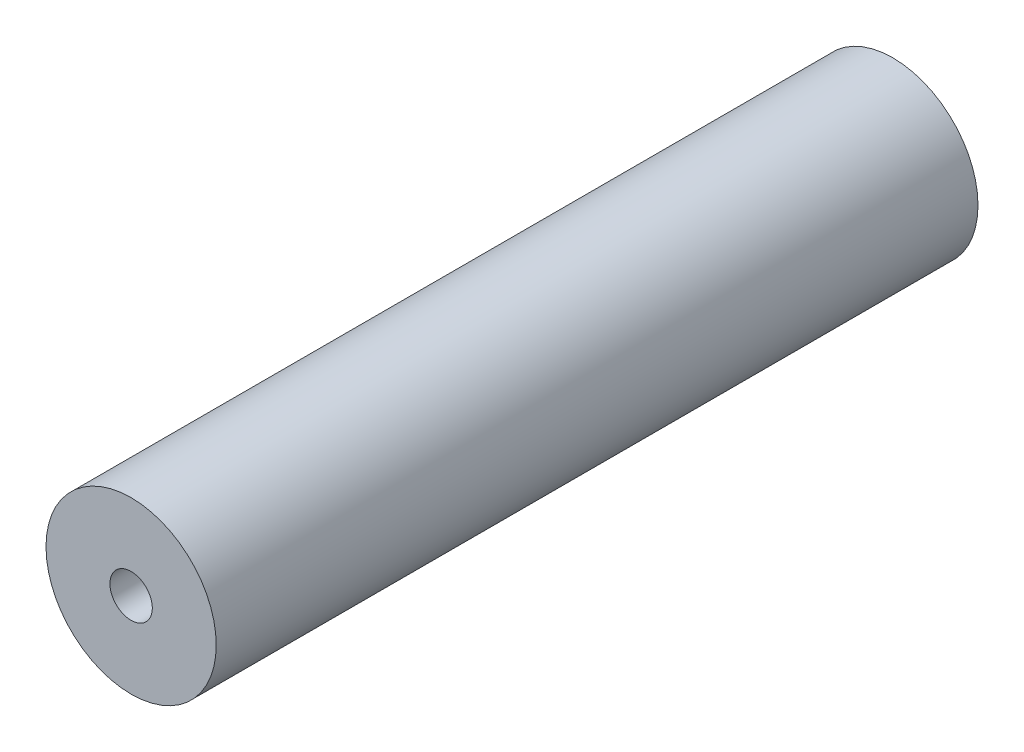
from build123d import *

# Parameters (mm, degrees)
SKETCH1_R           = 10
SKETCH1_R_2         = 2.4892
BOSS_EXTRUDE1_DEPTH = 89.5


with BuildPart() as part:
    # Sketch1 → Boss-Extrude1 (new body)
    with BuildSketch(Plane.XY):
        with Locations(Location((229.226497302, -84.2, 0), (0, 0, 180))):
            Circle(SKETCH1_R)
        with Locations(Location((229.226497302, -84.2, 0), (0, 0, 180))):
            Circle(SKETCH1_R_2, mode=Mode.SUBTRACT)
    extrude(amount=BOSS_EXTRUDE1_DEPTH)


solid = part.part
